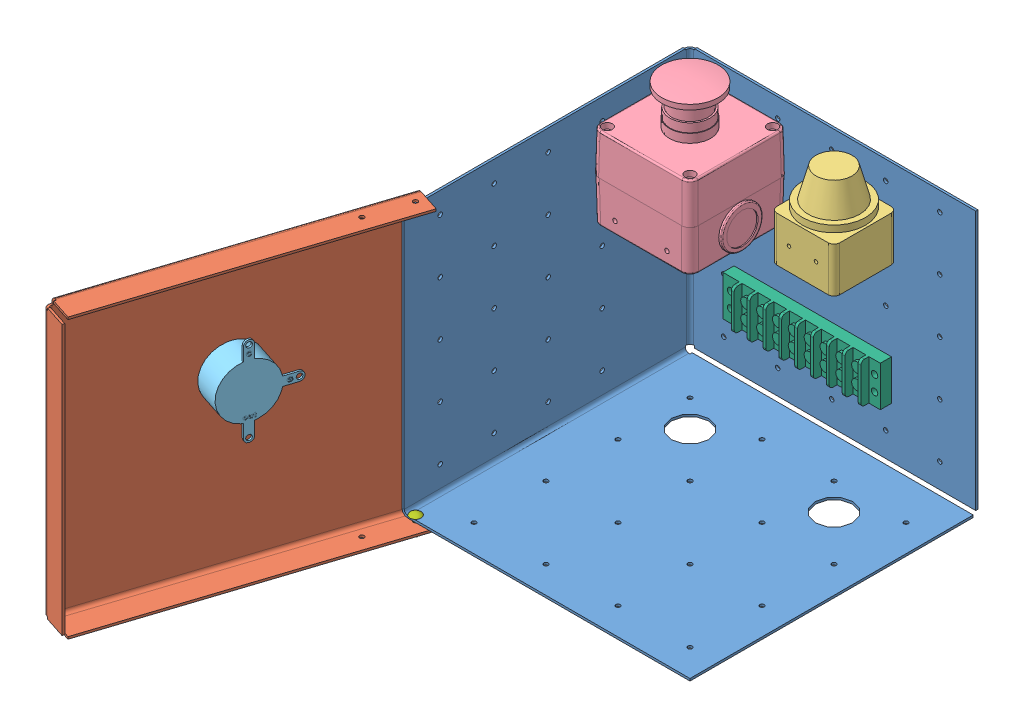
SolidWorks assembly Basic_Electrical_Lab.SLDASM, configuration Default (file format 13000). Lengths in mm.
Overall size (269.46 226.95 396.47).
7 component instances, 7 part files, 17 mates.
Components (placement in the parent):
- box2-1: box2.SLDPRT [Default] at origin size (203.2 186.37 203.2)
- cover_2-1: cover_2.SLDPRT [Default] at (96.159 -1254.76 -104.6335) x (-0.309017 0 0.951057) z (-0.951057 0 -0.309017) size (209.55 196.85 20.64)
- light_2-1: light_2.SLDPRT [Default] at (292.1 186.3725 177.8) x (-1 0 0) z (0 -1 0) size (44.45 44.45 58.74)
- E-StopSwitch_2-1: E-StopSwitch_2.SLDPRT [Default] at (50.8 157.9245 50.8) x (0 0 1) z (0 1 0) size (70 92.29 87.45)
- speed_control_2-1: speed_control_2.SLDPRT [Default] at (-14.2513 115.2525 296.8214) x (0.309017 0 -0.951057) z (0 1 0) size (51.5 40 62.97)
- SW3dPS-Terminal Block_2-2: SW3dPS-Terminal Block_2.SLDPRT [Default] at (143.764 67.6275 1.5875) x (-1 0 0) z (0 0 1) size (111.13 28.45 19.91)
- Pin_2-1: Pin_2.SLDPRT [Default] at (6.35 1.5875 200.025) size (7.94 14.29 7.94)
Mates (geometry in assembly coordinates):
- Concentric1: concentric: cylinder of box2-1 through (6.35 0 200.025) axis (0 1 0) radius 1.5875; cylinder of cover_2-1 through (6.35 -3.81 200.025) axis (0 1 0) radius 1.5875
- Distance1: distance = 5.08 mm: line of box2-1 through (1.5875 186.3725 4.9213) axis (0 0 1); plane of cover_2-1 through (-66.256 191.4525 390.091) normal (0 -1 0)
- Coincident3: coincident: line of box2-1 through (1.5875 186.3725 4.9213) axis (0 0 1); plane of E-StopSwitch_2-1 through (15.8 186.3725 15.8) normal (0 1 0)
- Concentric3: concentric: cylinder of box2-1 through (50.8 0 50.8) axis (0 -1 0) radius 13.081; cylinder of E-StopSwitch_2-1 through (50.8 192.4685 50.8) axis (0 -1 0) radius 14.5415
- Coincident5: coincident: line of box2-1 through (203.2 186.3725 1.5875) axis (-1 0 0); plane of light_2-1 through (133.985 186.3725 32.385) normal (0 1 0)
- Concentric4: concentric: cylinder of box2-1 through (152.4 0 50.8) axis (0 -1 0) radius 13.081; cylinder of light_2-1 through (152.4 186.3725 50.8) axis (0 -1 0) radius 22.225
- Parallel2: parallel: plane of light_2-1 through (133.985 154.6225 28.575) normal (0 0 -1); plane of box2-1 through (203.2 0 1.5875) normal (0 0 1)
- Coincident7: coincident: plane of cover_2-1 through (0.0083 -3.81 191.2877) normal (0.951057 0 0.309017); plane of speed_control_2-1 through (-32.3689 115.2525 290.9346) normal (-0.951057 0 -0.309017)
- Concentric5: concentric: cylinder of cover_2-1 through (-33.8787 115.2525 290.4441) axis (-0.951057 0 -0.309017) radius 4.7625; cylinder of speed_control_2-1 through (-50.4865 115.2525 285.0479) axis (0.951057 0 0.309017) radius 3.048
- Parallel6: parallel: plane of speed_control_2-1 through (-14.478 143.5611 293.4094) normal (0.309017 0 -0.951057); line of cover_2-1 through (-46.6285 -0.4264 396.4684) axis (0 1 0)
- Angle1: planar angle = 0.314159 rad: plane of box2-1 through (0 190.5 203.2) normal (-1 0 0); plane of cover_2-1 through (-1.5015 -3.81 190.7971) normal (-0.951057 0 -0.309017)
- Parallel4: parallel: plane of box2-1 through (1.5875 190.5 203.2) normal (1 0 0); line of E-StopSwitch_2-1 through (85.8 157.9245 80.2636) axis (0 0 -1)
- Coincident142: coincident: plane of box2-1 through (203.2 0 1.5875) normal (0 0 1); plane of SW3dPS-Terminal Block_2-2 through (143.764 67.6275 1.5875) normal (0 0 -1)
- Parallel5: parallel: line of box2-1 through (203.2 3.3836 1.5875) axis (0 1 0); plane of SW3dPS-Terminal Block_2-2 through (143.764 67.6275 9.4615) normal (1 0 0)
- Concentric6: concentric: cylinder of box2-1 through (139.7 58.7375 1.5875) axis (0 0 1) radius 1.5875; cylinder of SW3dPS-Terminal Block_2-2 through (139.7 58.7375 1.5875) axis (0 0 1) radius 2.286
- Concentric8: concentric: cylinder of box2-1 through (6.35 0 200.025) axis (0 1 0) radius 1.5875; cylinder of Pin_2-1 through (6.35 5.1195 200.025) axis (0 1 0) radius 1.397
- Coincident144: coincident: plane of box2-1 through (0 1.5875 203.2) normal (0 1 0); plane of Pin_2-1 through (7.747 1.5875 200.025) normal (0 -1 0)
